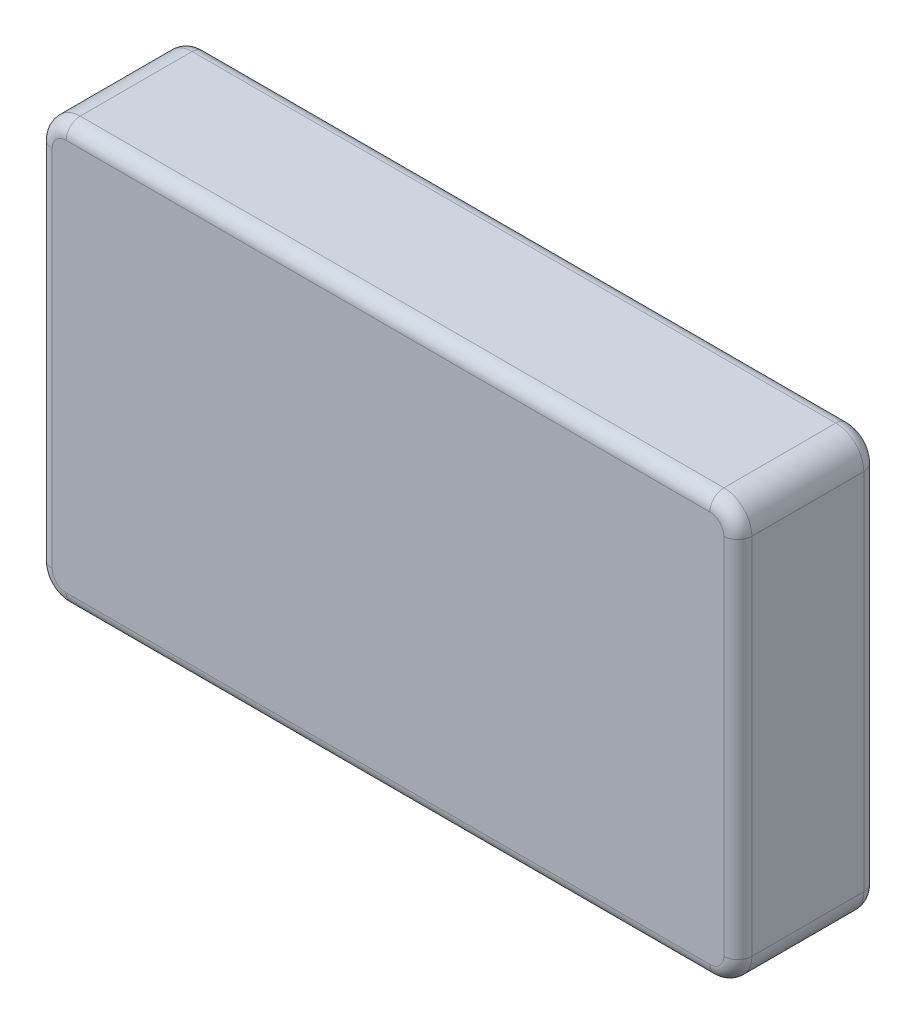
from build123d import *

# Parameters (mm, degrees)
SKETCH1_W      = 63.5
SKETCH1_H      = 38.1
EXTRUDE1_DEPTH = 12.7
FILLET1_R      = 2.54
FILLET2_R      = 1.27


with BuildPart() as part:
    # Sketch1 → Extrude1 (new body)
    with BuildSketch(Plane.XY):
        with Locations((10.653759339, 8.228612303)):
            Rectangle(SKETCH1_W, SKETCH1_H)
    extrude(amount=EXTRUDE1_DEPTH)

    # Fillet1
    fillet1_edges = [part.edges().sort_by_distance(p)[0] for p in [
        (-21.096240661, 27.278612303, 6.35),
        (42.403759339, 27.278612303, 6.35),
        (42.403759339, -10.821387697, 6.35),
        (-21.096240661, -10.821387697, 6.35),
    ]]
    fillet(fillet1_edges, radius=FILLET1_R)

    # Fillet2
    fillet2_edges = [part.edges().sort_by_distance(p)[0] for p in [
        (10.653759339, -10.821387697, 0),
        (10.653759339, -10.821387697, 12.7),
        (-21.096240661, 8.228612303, 0),
        (10.653759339, 27.278612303, 0),
        (42.403759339, 8.228612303, 0),
        (41.659810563, 26.534663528, 0),
        (-20.352291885, 26.534663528, 0),
        (41.659810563, -10.077438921, 0),
        (-20.352291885, -10.077438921, 0),
        (-21.096240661, 8.228612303, 12.7),
        (42.403759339, 8.228612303, 12.7),
        (10.653759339, 27.278612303, 12.7),
        (41.659810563, 26.534663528, 12.7),
        (-20.352291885, 26.534663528, 12.7),
        (41.659810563, -10.077438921, 12.7),
        (-20.352291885, -10.077438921, 12.7),
    ]]
    fillet(fillet2_edges, radius=FILLET2_R)


solid = part.part
